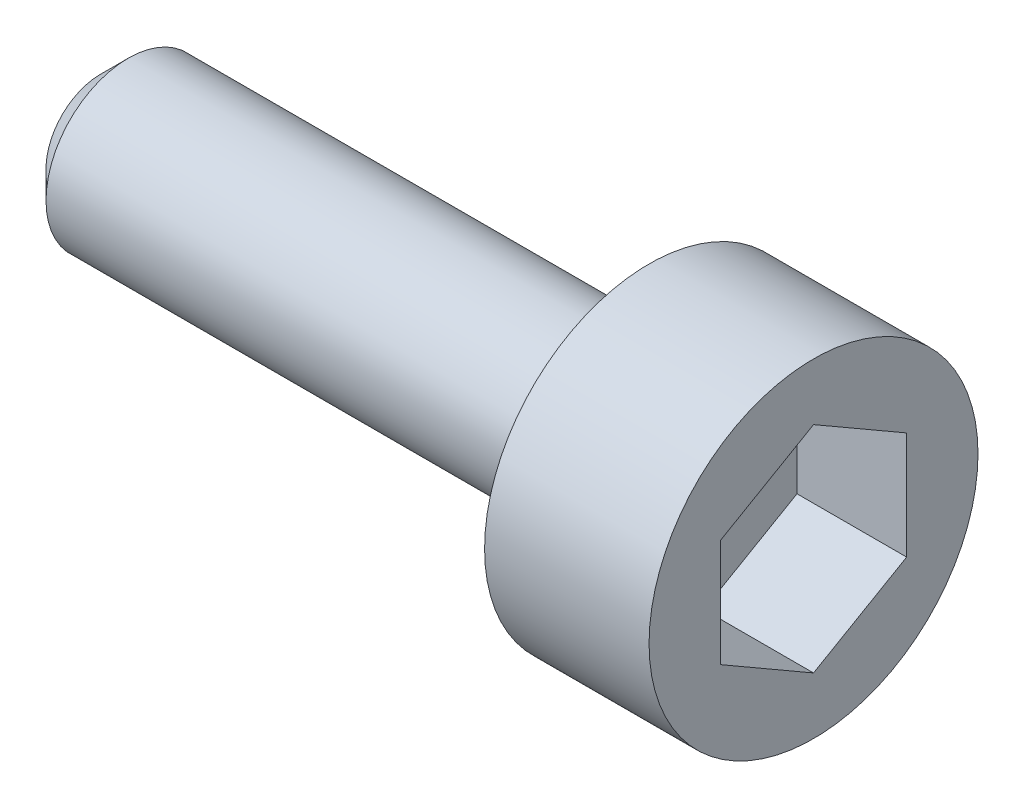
from build123d import *

# Parameters (mm, degrees)
CHANFREIN1_SIZE         = 0.5
ENL_V_MAT_EXTRU_1_DEPTH = 2


with BuildPart() as part:
    # Esquisse1 → R_volution1 (revolve)
    with BuildSketch(Plane.XY, mode=Mode.PRIVATE) as r_volution1_sk:
        Polygon((0, 0), (0, 1.5), (10, 1.5), (10, 3), (13, 3), (13, 0), align=None)
    revolve(r_volution1_sk.sketch.rotate(Axis((-28.311766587, 0, 0), (1, 0, 0)), 90), axis=Axis((-28.311766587, 0, 0), (1, 0, 0)))

    # Chanfrein1
    chanfrein1_edges = [part.edges().sort_by_distance(p)[0] for p in [
        (0, 0, -1.5),
    ]]
    chamfer(chanfrein1_edges, length=CHANFREIN1_SIZE)

    # Esquisse2 → Enl_v. mat.-Extru.1 (cut)
    with BuildSketch(Plane(origin=(13, 0, 0), x_dir=(0, 0, -1), z_dir=(1, 0, 0))):
        Polygon((0, -1.961348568), (1.698577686, -0.980674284), (1.698577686, 0.980674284), (0, 1.961348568), (-1.698577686, 0.980674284), (-1.698577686, -0.980674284), align=None)
    extrude(amount=-ENL_V_MAT_EXTRU_1_DEPTH, mode=Mode.SUBTRACT)


solid = part.part
